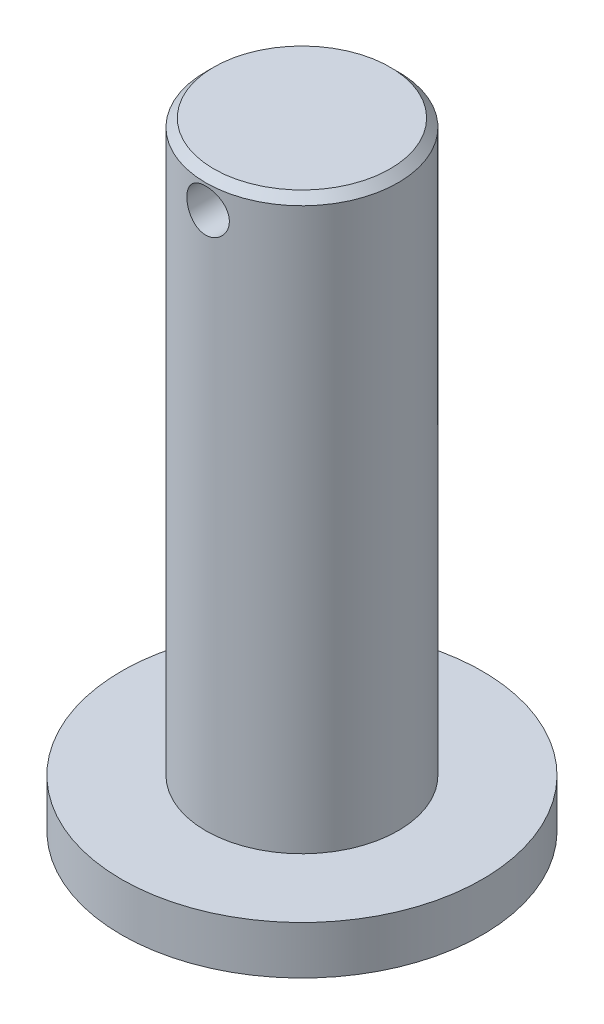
from build123d import *

# Parameters (mm, degrees)
ESQUISSE1_R      = 22.5
EXTRUSION1_DEPTH = 6
ESQUISSE2_R      = 12
EXTRUSION2_DEPTH = 71
CHANFREIN1_SIZE  = 1
ESQUISSE3_R      = 2.65
EXTRUSION3_DEPTH = 35.5


with BuildPart() as part:
    # Esquisse1 → Extrusion1 (new body)
    with BuildSketch(Plane(origin=(0, 0, 0), x_dir=(1, 0, 0), z_dir=(0, 1, 0))):
        with Locations(Location((0, 0, 0), (0, 0, 270))):
            Circle(ESQUISSE1_R)
    extrude(amount=EXTRUSION1_DEPTH)

    # Esquisse2 → Extrusion2 (add)
    with BuildSketch(Plane(origin=(0, 6, 0), x_dir=(1, 0, 0), z_dir=(0, 1, 0))):
        with Locations(Location((0, 0, 0), (0, 0, 270))):
            Circle(ESQUISSE2_R)
    extrude(amount=EXTRUSION2_DEPTH)

    # Chanfrein1
    chanfrein1_edges = [part.edges().sort_by_distance(p)[0] for p in [
        (0, 77, -12),
    ]]
    chamfer(chanfrein1_edges, length=CHANFREIN1_SIZE)

    # Esquisse3 → Extrusion3 (cut, symmetric)
    with BuildSketch(Plane.XY):
        with Locations(Location((0, 73, 0), (0, 0, 90.000000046))):
            Circle(ESQUISSE3_R)
    extrude(amount=EXTRUSION3_DEPTH, both=True, mode=Mode.SUBTRACT)


solid = part.part
